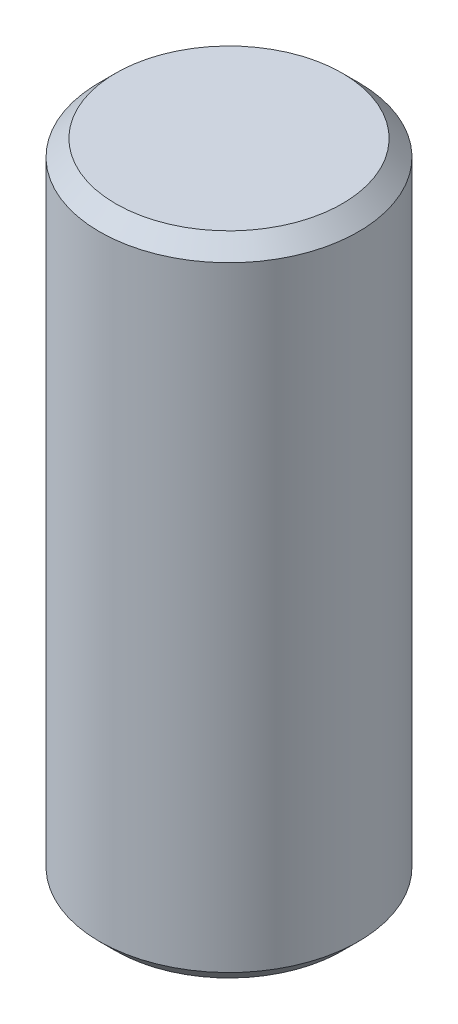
from build123d import *

# Parameters (mm, degrees)
SKETCH_1_R      = 8
EXTRUDE_1_DEPTH = 40
CHAMFER_1_SIZE  = 1


with BuildPart() as part:
    # Sketch 1 → Extrude 1 (new body)
    with BuildSketch(Plane(origin=(0, 0, 0), x_dir=(1, 0, 0), z_dir=(0, 1, 0))):
        with Locations(Location((0, 0, 0), (0, 0, 270))):
            Circle(SKETCH_1_R)
    extrude(amount=EXTRUDE_1_DEPTH)

    # Chamfer 1
    chamfer_1_edges = [part.edges().sort_by_distance(p)[0] for p in [
        (0, 0, -8),
        (0, 40, -8),
    ]]
    chamfer(chamfer_1_edges, length=CHAMFER_1_SIZE)


solid = part.part
